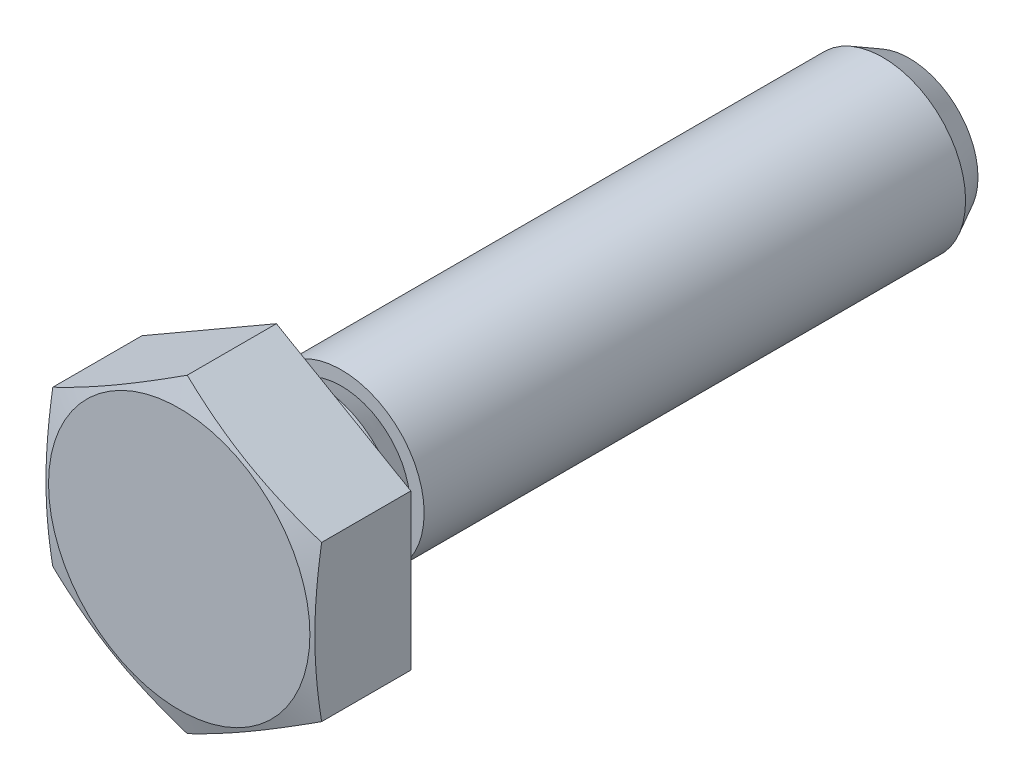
ISO-10303-21;
HEADER;
FILE_DESCRIPTION(('STEP AP214'),'2;1');
FILE_NAME('part.step','',(''),(''),'','','');
FILE_SCHEMA(('AUTOMOTIVE_DESIGN { 1 0 10303 214 1 1 1 1 }'));
ENDSEC;
DATA;
#1=APPLICATION_CONTEXT('core data for automotive mechanical design processes');
#2=APPLICATION_PROTOCOL_DEFINITION('international standard','automotive_design',2000,#1);
#3=PRODUCT_CONTEXT('',#1,'mechanical');
#4=PRODUCT('Part','Part','',(#3));
#5=PRODUCT_RELATED_PRODUCT_CATEGORY('part','',(#4));
#6=PRODUCT_DEFINITION_FORMATION('','',#4);
#7=PRODUCT_DEFINITION_CONTEXT('part definition',#1,'design');
#8=PRODUCT_DEFINITION('design','',#6,#7);
#9=PRODUCT_DEFINITION_SHAPE('','',#8);
#10=(LENGTH_UNIT() NAMED_UNIT(*) SI_UNIT(.MILLI.,.METRE.));
#11=(NAMED_UNIT(*) PLANE_ANGLE_UNIT() SI_UNIT($,.RADIAN.));
#12=(NAMED_UNIT(*) SI_UNIT($,.STERADIAN.) SOLID_ANGLE_UNIT());
#13=UNCERTAINTY_MEASURE_WITH_UNIT(LENGTH_MEASURE(1.E-05),#10,'distance_accuracy_value','');
#14=(GEOMETRIC_REPRESENTATION_CONTEXT(3) GLOBAL_UNCERTAINTY_ASSIGNED_CONTEXT((#13)) GLOBAL_UNIT_ASSIGNED_CONTEXT((#10,
#11,#12)) REPRESENTATION_CONTEXT('',''));
#15=CARTESIAN_POINT('',(0.,0.,0.));
#16=DIRECTION('',(0.,0.,1.));
#17=DIRECTION('',(1.,0.,0.));
#18=AXIS2_PLACEMENT_3D('',#15,#16,#17);
#19=CARTESIAN_POINT('',(0.,0.,0.6));
#20=DIRECTION('',(0.,0.,1.));
#21=DIRECTION('',(1.,0.,0.));
#22=AXIS2_PLACEMENT_3D('',#19,#20,#21);
#23=TOROIDAL_SURFACE('',#22,5.1,0.6);
#24=CARTESIAN_POINT('',(0.,0.,0.6));
#25=DIRECTION('',(0.,0.,1.));
#26=DIRECTION('',(1.,0.,0.));
#27=AXIS2_PLACEMENT_3D('',#24,#25,#26);
#28=CIRCLE('',#27,5.7);
#29=CARTESIAN_POINT('',(5.7,0.,0.6));
#30=VERTEX_POINT('',#29);
#31=EDGE_CURVE('E11',#30,#30,#28,.T.);
#32=ORIENTED_EDGE('',*,*,#31,.F.);
#33=EDGE_LOOP('',(#32));
#34=FACE_BOUND('',#33,.T.);
#35=CARTESIAN_POINT('',(0.,0.,0.));
#36=DIRECTION('',(0.,0.,1.));
#37=DIRECTION('',(1.,0.,0.));
#38=AXIS2_PLACEMENT_3D('',#35,#36,#37);
#39=CIRCLE('',#38,5.1);
#40=CARTESIAN_POINT('',(5.1,0.,0.));
#41=VERTEX_POINT('',#40);
#42=EDGE_CURVE('E24',#41,#41,#39,.T.);
#43=ORIENTED_EDGE('',*,*,#42,.T.);
#44=EDGE_LOOP('',(#43));
#45=FACE_BOUND('',#44,.T.);
#46=ADVANCED_FACE('F17',(#34,#45),#23,.T.);
#47=CARTESIAN_POINT('',(0.,5.1,0.));
#48=DIRECTION('',(0.,0.,-1.));
#49=DIRECTION('',(-1.,0.,0.));
#50=AXIS2_PLACEMENT_3D('',#47,#48,#49);
#51=PLANE('',#50);
#52=CARTESIAN_POINT('',(0.,0.,0.));
#53=DIRECTION('',(0.,0.,1.));
#54=DIRECTION('',(1.,0.,0.));
#55=AXIS2_PLACEMENT_3D('',#52,#53,#54);
#56=CIRCLE('',#55,4.4);
#57=CARTESIAN_POINT('',(4.4,0.,0.));
#58=VERTEX_POINT('',#57);
#59=EDGE_CURVE('E118',#58,#58,#56,.T.);
#60=ORIENTED_EDGE('',*,*,#59,.T.);
#61=EDGE_LOOP('',(#60));
#62=FACE_BOUND('',#61,.T.);
#63=ORIENTED_EDGE('',*,*,#42,.F.);
#64=EDGE_LOOP('',(#63));
#65=FACE_BOUND('',#64,.T.);
#66=ADVANCED_FACE('F124',(#62,#65),#51,.T.);
#67=CARTESIAN_POINT('',(0.,0.,-0.4));
#68=DIRECTION('',(0.,0.,1.));
#69=DIRECTION('',(1.,0.,0.));
#70=AXIS2_PLACEMENT_3D('',#67,#68,#69);
#71=TOROIDAL_SURFACE('',#70,4.4,0.4);
#72=CARTESIAN_POINT('',(0.,0.,-0.4));
#73=DIRECTION('',(0.,0.,1.));
#74=DIRECTION('',(1.,0.,0.));
#75=AXIS2_PLACEMENT_3D('',#72,#73,#74);
#76=CIRCLE('',#75,4.);
#77=CARTESIAN_POINT('',(4.,0.,-0.4));
#78=VERTEX_POINT('',#77);
#79=EDGE_CURVE('E115',#78,#78,#76,.T.);
#80=ORIENTED_EDGE('',*,*,#79,.T.);
#81=EDGE_LOOP('',(#80));
#82=FACE_BOUND('',#81,.T.);
#83=ORIENTED_EDGE('',*,*,#59,.F.);
#84=EDGE_LOOP('',(#83));
#85=FACE_BOUND('',#84,.T.);
#86=ADVANCED_FACE('F126',(#82,#85),#71,.F.);
#87=CARTESIAN_POINT('',(0.,0.,0.6));
#88=DIRECTION('',(0.,0.,1.));
#89=DIRECTION('',(1.,0.,0.));
#90=AXIS2_PLACEMENT_3D('',#87,#88,#89);
#91=CYLINDRICAL_SURFACE('',#90,4.);
#92=CARTESIAN_POINT('',(0.,0.,-1.37215937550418));
#93=DIRECTION('',(0.,0.,1.));
#94=DIRECTION('',(1.,0.,0.));
#95=AXIS2_PLACEMENT_3D('',#92,#93,#94);
#96=CIRCLE('',#95,4.);
#97=CARTESIAN_POINT('',(4.,0.,-1.37215937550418));
#98=VERTEX_POINT('',#97);
#99=EDGE_CURVE('E112',#98,#98,#96,.T.);
#100=ORIENTED_EDGE('',*,*,#99,.T.);
#101=EDGE_LOOP('',(#100));
#102=FACE_BOUND('',#101,.T.);
#103=ORIENTED_EDGE('',*,*,#79,.F.);
#104=EDGE_LOOP('',(#103));
#105=FACE_BOUND('',#104,.T.);
#106=ADVANCED_FACE('F133',(#102,#105),#91,.T.);
#107=CARTESIAN_POINT('',(0.,0.,-1.37215937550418));
#108=DIRECTION('',(0.,0.,1.));
#109=DIRECTION('',(1.,0.,0.));
#110=AXIS2_PLACEMENT_3D('',#107,#108,#109);
#111=CONICAL_SURFACE('',#110,4.,0.523598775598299);
#112=CARTESIAN_POINT('',(0.,0.,-2.544));
#113=DIRECTION('',(0.,0.,1.));
#114=DIRECTION('',(1.,0.,0.));
#115=AXIS2_PLACEMENT_3D('',#112,#113,#114);
#116=CIRCLE('',#115,3.3234375);
#117=CARTESIAN_POINT('',(3.3234375,0.,-2.544));
#118=VERTEX_POINT('',#117);
#119=EDGE_CURVE('E109',#118,#118,#116,.T.);
#120=ORIENTED_EDGE('',*,*,#119,.T.);
#121=EDGE_LOOP('',(#120));
#122=FACE_BOUND('',#121,.T.);
#123=ORIENTED_EDGE('',*,*,#99,.F.);
#124=EDGE_LOOP('',(#123));
#125=FACE_BOUND('',#124,.T.);
#126=ADVANCED_FACE('F140',(#122,#125),#111,.T.);
#127=CARTESIAN_POINT('',(0.,3.3234375,-2.544));
#128=DIRECTION('',(0.,0.,1.));
#129=DIRECTION('',(1.,0.,0.));
#130=AXIS2_PLACEMENT_3D('',#127,#128,#129);
#131=PLANE('',#130);
#132=CARTESIAN_POINT('',(0.,0.,-2.544));
#133=DIRECTION('',(0.,0.,1.));
#134=DIRECTION('',(1.,0.,0.));
#135=AXIS2_PLACEMENT_3D('',#132,#133,#134);
#136=CIRCLE('',#135,4.);
#137=CARTESIAN_POINT('',(4.,0.,-2.544));
#138=VERTEX_POINT('',#137);
#139=EDGE_CURVE('E106',#138,#138,#136,.T.);
#140=ORIENTED_EDGE('',*,*,#139,.T.);
#141=EDGE_LOOP('',(#140));
#142=FACE_BOUND('',#141,.T.);
#143=ORIENTED_EDGE('',*,*,#119,.F.);
#144=EDGE_LOOP('',(#143));
#145=FACE_BOUND('',#144,.T.);
#146=ADVANCED_FACE('F144',(#142,#145),#131,.T.);
#147=CARTESIAN_POINT('',(0.,0.,0.6));
#148=DIRECTION('',(0.,0.,1.));
#149=DIRECTION('',(1.,0.,0.));
#150=AXIS2_PLACEMENT_3D('',#147,#148,#149);
#151=CYLINDRICAL_SURFACE('',#150,4.);
#152=CARTESIAN_POINT('',(0.,0.,-28.7234375));
#153=DIRECTION('',(0.,0.,1.));
#154=DIRECTION('',(1.,0.,0.));
#155=AXIS2_PLACEMENT_3D('',#152,#153,#154);
#156=CIRCLE('',#155,4.);
#157=CARTESIAN_POINT('',(4.,0.,-28.7234375));
#158=VERTEX_POINT('',#157);
#159=EDGE_CURVE('E103',#158,#158,#156,.T.);
#160=ORIENTED_EDGE('',*,*,#159,.T.);
#161=EDGE_LOOP('',(#160));
#162=FACE_BOUND('',#161,.T.);
#163=ORIENTED_EDGE('',*,*,#139,.F.);
#164=EDGE_LOOP('',(#163));
#165=FACE_BOUND('',#164,.T.);
#166=ADVANCED_FACE('F148',(#162,#165),#151,.T.);
#167=CARTESIAN_POINT('',(0.,0.,-28.7234375));
#168=DIRECTION('',(0.,0.,1.));
#169=DIRECTION('',(1.,0.,0.));
#170=AXIS2_PLACEMENT_3D('',#167,#168,#169);
#171=CONICAL_SURFACE('',#170,4.,0.487349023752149);
#172=CARTESIAN_POINT('',(0.,0.,-30.));
#173=DIRECTION('',(0.,0.,1.));
#174=DIRECTION('',(1.,0.,0.));
#175=AXIS2_PLACEMENT_3D('',#172,#173,#174);
#176=CIRCLE('',#175,3.3234375);
#177=CARTESIAN_POINT('',(3.3234375,0.,-30.));
#178=VERTEX_POINT('',#177);
#179=EDGE_CURVE('E100',#178,#178,#176,.T.);
#180=ORIENTED_EDGE('',*,*,#179,.T.);
#181=EDGE_LOOP('',(#180));
#182=FACE_BOUND('',#181,.T.);
#183=ORIENTED_EDGE('',*,*,#159,.F.);
#184=EDGE_LOOP('',(#183));
#185=FACE_BOUND('',#184,.T.);
#186=ADVANCED_FACE('F152',(#182,#185),#171,.T.);
#187=CARTESIAN_POINT('',(0.,3.3234375,-30.));
#188=DIRECTION('',(0.,0.,-1.));
#189=DIRECTION('',(-1.,0.,0.));
#190=AXIS2_PLACEMENT_3D('',#187,#188,#189);
#191=PLANE('',#190);
#192=ORIENTED_EDGE('',*,*,#179,.F.);
#193=EDGE_LOOP('',(#192));
#194=FACE_BOUND('',#193,.T.);
#195=ADVANCED_FACE('F156',(#194),#191,.T.);
#196=CARTESIAN_POINT('',(-6.5,-3.752775,0.6));
#197=DIRECTION('',(0.,0.,-1.));
#198=DIRECTION('',(-1.,0.,0.));
#199=AXIS2_PLACEMENT_3D('',#196,#197,#198);
#200=PLANE('',#199);
#201=DIRECTION('',(0.,-1.,0.));
#202=VECTOR('',#201,1.);
#203=CARTESIAN_POINT('',(-6.5,3.752775,0.6));
#204=LINE('',#203,#202);
#205=CARTESIAN_POINT('',(-6.5,3.752775,0.6));
#206=VERTEX_POINT('',#205);
#207=CARTESIAN_POINT('',(-6.5,-3.752775,0.6));
#208=VERTEX_POINT('',#207);
#209=EDGE_CURVE('E83',#206,#208,#204,.T.);
#210=ORIENTED_EDGE('',*,*,#209,.F.);
#211=DIRECTION('',(0.866025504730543,0.499999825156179,0.));
#212=VECTOR('',#211,1.);
#213=CARTESIAN_POINT('',(-6.5,3.752775,0.6));
#214=LINE('',#213,#212);
#215=CARTESIAN_POINT('',(0.,7.50555,0.6));
#216=VERTEX_POINT('',#215);
#217=EDGE_CURVE('E88',#206,#216,#214,.T.);
#218=ORIENTED_EDGE('',*,*,#217,.T.);
#219=DIRECTION('',(0.866025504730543,-0.499999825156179,0.));
#220=VECTOR('',#219,1.);
#221=CARTESIAN_POINT('',(0.,7.50555,0.6));
#222=LINE('',#221,#220);
#223=CARTESIAN_POINT('',(6.5,3.752775,0.6));
#224=VERTEX_POINT('',#223);
#225=EDGE_CURVE('E94',#216,#224,#222,.T.);
#226=ORIENTED_EDGE('',*,*,#225,.T.);
#227=DIRECTION('',(0.,-1.,0.));
#228=VECTOR('',#227,1.);
#229=CARTESIAN_POINT('',(6.5,3.752775,0.6));
#230=LINE('',#229,#228);
#231=CARTESIAN_POINT('',(6.5,-3.752775,0.6));
#232=VERTEX_POINT('',#231);
#233=EDGE_CURVE('E246',#224,#232,#230,.T.);
#234=ORIENTED_EDGE('',*,*,#233,.T.);
#235=DIRECTION('',(-0.866025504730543,-0.499999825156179,0.));
#236=VECTOR('',#235,1.);
#237=CARTESIAN_POINT('',(6.5,-3.752775,0.6));
#238=LINE('',#237,#236);
#239=CARTESIAN_POINT('',(0.,-7.50555,0.6));
#240=VERTEX_POINT('',#239);
#241=EDGE_CURVE('E232',#232,#240,#238,.T.);
#242=ORIENTED_EDGE('',*,*,#241,.T.);
#243=DIRECTION('',(-0.866025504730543,0.499999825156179,0.));
#244=VECTOR('',#243,1.);
#245=CARTESIAN_POINT('',(0.,-7.50555,0.6));
#246=LINE('',#245,#244);
#247=EDGE_CURVE('E230',#240,#208,#246,.T.);
#248=ORIENTED_EDGE('',*,*,#247,.T.);
#249=EDGE_LOOP('',(#210,#218,#226,#234,#242,#248));
#250=FACE_BOUND('',#249,.T.);
#251=ORIENTED_EDGE('',*,*,#31,.T.);
#252=EDGE_LOOP('',(#251));
#253=FACE_BOUND('',#252,.T.);
#254=ADVANCED_FACE('F160',(#250,#253),#200,.T.);
#255=CARTESIAN_POINT('',(-6.5,3.752775,0.6));
#256=DIRECTION('',(-1.,0.,0.));
#257=DIRECTION('',(0.,0.,1.));
#258=AXIS2_PLACEMENT_3D('',#255,#256,#257);
#259=PLANE('',#258);
#260=CARTESIAN_POINT('',(-6.5,4.3898181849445,4.80301736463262));
#261=CARTESIAN_POINT('',(-6.5,4.09098114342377,4.85753275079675));
#262=CARTESIAN_POINT('',(-6.5,3.79142042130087,4.90839258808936));
#263=CARTESIAN_POINT('',(-6.5,3.19074376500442,5.00106933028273));
#264=CARTESIAN_POINT('',(-6.5,2.88962706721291,5.04288125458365));
#265=CARTESIAN_POINT('',(-6.5,2.28634005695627,5.11563270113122));
#266=CARTESIAN_POINT('',(-6.5,1.98417098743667,5.14658231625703));
#267=CARTESIAN_POINT('',(-6.5,1.37885610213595,5.19600650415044));
#268=CARTESIAN_POINT('',(-6.5,1.0757104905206,5.21448353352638));
#269=CARTESIAN_POINT('',(-6.5,0.473199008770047,5.23765885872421));
#270=CARTESIAN_POINT('',(-6.5,0.173840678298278,5.24254932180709));
#271=CARTESIAN_POINT('',(-6.5,-0.424803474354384,5.23878261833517));
#272=CARTESIAN_POINT('',(-6.5,-0.724089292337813,5.23012479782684));
#273=CARTESIAN_POINT('',(-6.5,-1.32190400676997,5.19982341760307));
#274=CARTESIAN_POINT('',(-6.5,-1.62043309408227,5.1781835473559));
#275=CARTESIAN_POINT('',(-6.5,-2.21639634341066,5.12318405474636));
#276=CARTESIAN_POINT('',(-6.5,-2.51383048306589,5.08982419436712));
#277=CARTESIAN_POINT('',(-6.5,-3.10949215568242,5.01274668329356));
#278=CARTESIAN_POINT('',(-6.5,-3.4077102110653,4.96895683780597));
#279=CARTESIAN_POINT('',(-6.5,-4.00275973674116,4.87287774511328));
#280=CARTESIAN_POINT('',(-6.5,-4.29959119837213,4.82058844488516));
#281=CARTESIAN_POINT('',(-6.5,-4.89215745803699,4.70904950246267));
#282=CARTESIAN_POINT('',(-6.5,-5.18789129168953,4.6497947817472));
#283=CARTESIAN_POINT('',(-6.5,-5.77818646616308,4.52569811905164));
#284=CARTESIAN_POINT('',(-6.5,-6.0727477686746,4.46085599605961));
#285=CARTESIAN_POINT('',(-6.5,-6.66575277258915,4.32556160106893));
#286=CARTESIAN_POINT('',(-6.5,-6.96417913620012,4.25503370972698));
#287=CARTESIAN_POINT('',(-6.5,-7.56012687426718,4.11024969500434));
#288=CARTESIAN_POINT('',(-6.5,-7.85764823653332,4.03599352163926));
#289=CARTESIAN_POINT('',(-6.5,-8.45129351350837,3.88463909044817));
#290=CARTESIAN_POINT('',(-6.5,-8.7474190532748,3.80754718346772));
#291=CARTESIAN_POINT('',(-6.5,-9.33900160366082,3.65091210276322));
#292=CARTESIAN_POINT('',(-6.5,-9.63445865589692,3.57136908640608));
#293=CARTESIAN_POINT('',(-6.5,-9.9296486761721,3.49086478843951));
#294=B_SPLINE_CURVE_WITH_KNOTS('',3,(#260,#261,#262,#263,#264,#265,#266,#267,#268,#269,#270,
#271,#272,#273,#274,#275,#276,#277,#278,#279,#280,#281,#282,#283,#284,#285,#286,#287,#288,#289,
#290,#291,#292,#293),.UNSPECIFIED.,.F.,.F.,(4,2,2,2,2,2,2,2,2,2,2,2,2,2,2,2,4),(0.,
0.911367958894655,1.82323632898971,2.73425516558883,3.64509451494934,4.54298379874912,
5.44091642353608,6.33859397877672,7.23628976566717,8.14038972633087,9.04449532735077,
9.94926425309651,10.8540625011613,11.7739744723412,12.6938987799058,13.6118752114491,
14.5297928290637),.UNSPECIFIED.);
#295=CARTESIAN_POINT('',(-6.5,3.752775,4.91320410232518));
#296=VERTEX_POINT('',#295);
#297=CARTESIAN_POINT('',(-6.5,-3.752775,4.91320410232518));
#298=VERTEX_POINT('',#297);
#299=EDGE_CURVE('E72',#296,#298,#294,.T.);
#300=ORIENTED_EDGE('',*,*,#299,.F.);
#301=DIRECTION('',(0.,0.,1.));
#302=VECTOR('',#301,1.);
#303=CARTESIAN_POINT('',(-6.5,3.752775,0.6));
#304=LINE('',#303,#302);
#305=EDGE_CURVE('E81',#206,#296,#304,.T.);
#306=ORIENTED_EDGE('',*,*,#305,.F.);
#307=ORIENTED_EDGE('',*,*,#209,.T.);
#308=DIRECTION('',(0.,0.,1.));
#309=VECTOR('',#308,1.);
#310=CARTESIAN_POINT('',(-6.5,-3.752775,0.6));
#311=LINE('',#310,#309);
#312=EDGE_CURVE('E39',#208,#298,#311,.T.);
#313=ORIENTED_EDGE('',*,*,#312,.T.);
#314=EDGE_LOOP('',(#300,#306,#307,#313));
#315=FACE_BOUND('',#314,.T.);
#316=ADVANCED_FACE('F79',(#315),#259,.T.);
#317=CARTESIAN_POINT('',(0.,-7.50555,0.6));
#318=DIRECTION('',(0.499999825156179,0.866025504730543,0.));
#319=DIRECTION('',(0.866025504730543,-0.499999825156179,0.));
#320=AXIS2_PLACEMENT_3D('',#317,#318,#319);
#321=PLANE('',#320);
#322=DIRECTION('',(0.,0.,1.));
#323=VECTOR('',#322,1.);
#324=CARTESIAN_POINT('',(0.,-7.50555,0.6));
#325=LINE('',#324,#323);
#326=CARTESIAN_POINT('',(0.,-7.50555,4.91320495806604));
#327=VERTEX_POINT('',#326);
#328=EDGE_CURVE('E237',#240,#327,#325,.T.);
#329=ORIENTED_EDGE('',*,*,#328,.T.);
#330=CARTESIAN_POINT('',(2.00000000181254E-07,-7.50555011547,4.91320492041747));
#331=CARTESIAN_POINT('',(-0.269500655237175,-7.34995379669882,4.96395435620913));
#332=CARTESIAN_POINT('',(-0.539719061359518,-7.19394319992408,5.01007955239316));
#333=CARTESIAN_POINT('',(-1.08156698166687,-6.88110730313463,5.09118099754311));
#334=CARTESIAN_POINT('',(-1.35319726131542,-6.72428156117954,5.12615037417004));
#335=CARTESIAN_POINT('',(-1.89544179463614,-6.41121667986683,5.1827563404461));
#336=CARTESIAN_POINT('',(-2.16604804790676,-6.25498215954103,5.2044923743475));
#337=CARTESIAN_POINT('',(-2.70776966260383,-5.94221918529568,5.23364290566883));
#338=CARTESIAN_POINT('',(-2.97888485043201,-5.78569083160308,5.24106162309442));
#339=CARTESIAN_POINT('',(-3.52111522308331,-5.47263412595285,5.24106153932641));
#340=CARTESIAN_POINT('',(-3.79223040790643,-5.31610577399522,5.23364273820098));
#341=CARTESIAN_POINT('',(-4.33395201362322,-5.00334280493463,5.20449204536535));
#342=CARTESIAN_POINT('',(-4.60455826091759,-4.84710828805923,5.1827559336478));
#343=CARTESIAN_POINT('',(-5.14680278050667,-4.53404341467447,5.12614982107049));
#344=CARTESIAN_POINT('',(-5.41843305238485,-4.37721767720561,5.0911803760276));
#345=CARTESIAN_POINT('',(-5.96028095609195,-4.06438179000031,5.01007880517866));
#346=CARTESIAN_POINT('',(-6.23049935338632,-3.90837119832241,4.96395355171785));
#347=CARTESIAN_POINT('',(-6.5000002,-3.75277488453,4.91320406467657));
#348=B_SPLINE_CURVE_WITH_KNOTS('',3,(#330,#331,#332,#333,#334,#335,#336,#337,#338,#339,#340,
#341,#342,#343,#344,#345,#346,#347),.UNSPECIFIED.,.F.,.F.,(4,2,2,2,2,2,2,2,4),(0.,
0.945987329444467,1.89255629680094,2.83192136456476,3.77100951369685,4.71009765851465,
5.64946272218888,6.59603168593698,7.54201901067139),.UNSPECIFIED.);
#349=EDGE_CURVE('E84',#327,#298,#348,.T.);
#350=ORIENTED_EDGE('',*,*,#349,.T.);
#351=ORIENTED_EDGE('',*,*,#312,.F.);
#352=ORIENTED_EDGE('',*,*,#247,.F.);
#353=EDGE_LOOP('',(#329,#350,#351,#352));
#354=FACE_BOUND('',#353,.T.);
#355=ADVANCED_FACE('F165',(#354),#321,.F.);
#356=CARTESIAN_POINT('',(6.5,-3.752775,0.6));
#357=DIRECTION('',(-0.499999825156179,0.866025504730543,0.));
#358=DIRECTION('',(0.866025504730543,0.499999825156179,0.));
#359=AXIS2_PLACEMENT_3D('',#356,#357,#358);
#360=PLANE('',#359);
#361=DIRECTION('',(0.,0.,1.));
#362=VECTOR('',#361,1.);
#363=CARTESIAN_POINT('',(6.5,-3.752775,0.6));
#364=LINE('',#363,#362);
#365=CARTESIAN_POINT('',(6.5,-3.752775,4.91320410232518));
#366=VERTEX_POINT('',#365);
#367=EDGE_CURVE('E240',#232,#366,#364,.T.);
#368=ORIENTED_EDGE('',*,*,#367,.T.);
#369=CARTESIAN_POINT('',(6.5000002,-3.75277488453,4.91320406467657));
#370=CARTESIAN_POINT('',(6.23049935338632,-3.9083711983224,4.96395355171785));
#371=CARTESIAN_POINT('',(5.96028095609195,-4.06438179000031,5.01007880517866));
#372=CARTESIAN_POINT('',(5.41843305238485,-4.3772176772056,5.0911803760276));
#373=CARTESIAN_POINT('',(5.14680278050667,-4.53404341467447,5.12614982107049));
#374=CARTESIAN_POINT('',(4.60455826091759,-4.84710828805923,5.1827559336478));
#375=CARTESIAN_POINT('',(4.33395201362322,-5.00334280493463,5.20449204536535));
#376=CARTESIAN_POINT('',(3.79223040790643,-5.31610577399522,5.23364273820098));
#377=CARTESIAN_POINT('',(3.52111522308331,-5.47263412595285,5.24106153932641));
#378=CARTESIAN_POINT('',(2.97888485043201,-5.78569083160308,5.24106162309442));
#379=CARTESIAN_POINT('',(2.70776966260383,-5.94221918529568,5.23364290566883));
#380=CARTESIAN_POINT('',(2.16604804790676,-6.25498215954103,5.2044923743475));
#381=CARTESIAN_POINT('',(1.89544179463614,-6.41121667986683,5.1827563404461));
#382=CARTESIAN_POINT('',(1.35319726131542,-6.72428156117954,5.12615037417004));
#383=CARTESIAN_POINT('',(1.08156698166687,-6.88110730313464,5.09118099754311));
#384=CARTESIAN_POINT('',(0.539719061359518,-7.19394319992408,5.01007955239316));
#385=CARTESIAN_POINT('',(0.269500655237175,-7.34995379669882,4.96395435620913));
#386=CARTESIAN_POINT('',(-1.99999999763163E-07,-7.50555011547,4.91320492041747));
#387=B_SPLINE_CURVE_WITH_KNOTS('',3,(#369,#370,#371,#372,#373,#374,#375,#376,#377,#378,#379,
#380,#381,#382,#383,#384,#385,#386),.UNSPECIFIED.,.F.,.F.,(4,2,2,2,2,2,2,2,4),(0.,
0.945987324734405,1.89255628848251,2.83192135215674,3.77100949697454,4.71009764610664,
5.64946271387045,6.59603168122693,7.54201901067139),.UNSPECIFIED.);
#388=EDGE_CURVE('E203',#366,#327,#387,.T.);
#389=ORIENTED_EDGE('',*,*,#388,.T.);
#390=ORIENTED_EDGE('',*,*,#328,.F.);
#391=ORIENTED_EDGE('',*,*,#241,.F.);
#392=EDGE_LOOP('',(#368,#389,#390,#391));
#393=FACE_BOUND('',#392,.T.);
#394=ADVANCED_FACE('F208',(#393),#360,.F.);
#395=CARTESIAN_POINT('',(6.5,3.752775,0.6));
#396=DIRECTION('',(-1.,0.,0.));
#397=DIRECTION('',(0.,0.,1.));
#398=AXIS2_PLACEMENT_3D('',#395,#396,#397);
#399=PLANE('',#398);
#400=DIRECTION('',(0.,0.,1.));
#401=VECTOR('',#400,1.);
#402=CARTESIAN_POINT('',(6.5,3.752775,0.6));
#403=LINE('',#402,#401);
#404=CARTESIAN_POINT('',(6.5,3.752775,4.91320410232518));
#405=VERTEX_POINT('',#404);
#406=EDGE_CURVE('E92',#224,#405,#403,.T.);
#407=ORIENTED_EDGE('',*,*,#406,.T.);
#408=CARTESIAN_POINT('',(6.5,4.3898181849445,4.80301736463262));
#409=CARTESIAN_POINT('',(6.5,4.09098114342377,4.85753275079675));
#410=CARTESIAN_POINT('',(6.5,3.79142042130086,4.90839258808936));
#411=CARTESIAN_POINT('',(6.5,3.19074376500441,5.00106933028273));
#412=CARTESIAN_POINT('',(6.5,2.88962706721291,5.04288125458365));
#413=CARTESIAN_POINT('',(6.5,2.28634005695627,5.11563270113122));
#414=CARTESIAN_POINT('',(6.5,1.98417098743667,5.14658231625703));
#415=CARTESIAN_POINT('',(6.5,1.37885610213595,5.19600650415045));
#416=CARTESIAN_POINT('',(6.5,1.0757104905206,5.21448353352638));
#417=CARTESIAN_POINT('',(6.5,0.473199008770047,5.23765885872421));
#418=CARTESIAN_POINT('',(6.5,0.173840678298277,5.24254932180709));
#419=CARTESIAN_POINT('',(6.5,-0.424803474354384,5.23878261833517));
#420=CARTESIAN_POINT('',(6.5,-0.724089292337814,5.23012479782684));
#421=CARTESIAN_POINT('',(6.5,-1.32190400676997,5.19982341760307));
#422=CARTESIAN_POINT('',(6.5,-1.62043309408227,5.1781835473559));
#423=CARTESIAN_POINT('',(6.5,-2.21639634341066,5.12318405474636));
#424=CARTESIAN_POINT('',(6.5,-2.51383048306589,5.08982419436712));
#425=CARTESIAN_POINT('',(6.5,-3.10949215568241,5.01274668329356));
#426=CARTESIAN_POINT('',(6.5,-3.4077102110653,4.96895683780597));
#427=CARTESIAN_POINT('',(6.5,-4.00275973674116,4.87287774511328));
#428=CARTESIAN_POINT('',(6.5,-4.29959119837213,4.82058844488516));
#429=CARTESIAN_POINT('',(6.5,-4.89215745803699,4.70904950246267));
#430=CARTESIAN_POINT('',(6.5,-5.18789129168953,4.6497947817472));
#431=CARTESIAN_POINT('',(6.5,-5.77818646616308,4.52569811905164));
#432=CARTESIAN_POINT('',(6.5,-6.0727477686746,4.46085599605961));
#433=CARTESIAN_POINT('',(6.5,-6.66575277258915,4.32556160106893));
#434=CARTESIAN_POINT('',(6.5,-6.96417913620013,4.25503370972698));
#435=CARTESIAN_POINT('',(6.5,-7.56012687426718,4.11024969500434));
#436=CARTESIAN_POINT('',(6.5,-7.85764823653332,4.03599352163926));
#437=CARTESIAN_POINT('',(6.5,-8.45129351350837,3.88463909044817));
#438=CARTESIAN_POINT('',(6.5,-8.7474190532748,3.80754718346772));
#439=CARTESIAN_POINT('',(6.5,-9.33900160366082,3.65091210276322));
#440=CARTESIAN_POINT('',(6.5,-9.63445865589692,3.57136908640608));
#441=CARTESIAN_POINT('',(6.5,-9.9296486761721,3.49086478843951));
#442=B_SPLINE_CURVE_WITH_KNOTS('',3,(#408,#409,#410,#411,#412,#413,#414,#415,#416,#417,#418,
#419,#420,#421,#422,#423,#424,#425,#426,#427,#428,#429,#430,#431,#432,#433,#434,#435,#436,#437,
#438,#439,#440,#441),.UNSPECIFIED.,.F.,.F.,(4,2,2,2,2,2,2,2,2,2,2,2,2,2,2,2,4),(0.,
0.911367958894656,1.82323632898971,2.73425516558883,3.64509451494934,4.54298379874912,
5.44091642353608,6.33859397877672,7.23628976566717,8.14038972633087,9.04449532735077,
9.94926425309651,10.8540625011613,11.7739744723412,12.6938987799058,13.6118752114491,
14.5297928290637),.UNSPECIFIED.);
#443=EDGE_CURVE('E198',#405,#366,#442,.T.);
#444=ORIENTED_EDGE('',*,*,#443,.T.);
#445=ORIENTED_EDGE('',*,*,#367,.F.);
#446=ORIENTED_EDGE('',*,*,#233,.F.);
#447=EDGE_LOOP('',(#407,#444,#445,#446));
#448=FACE_BOUND('',#447,.T.);
#449=ADVANCED_FACE('F211',(#448),#399,.F.);
#450=CARTESIAN_POINT('',(0.,7.50555,0.6));
#451=DIRECTION('',(-0.499999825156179,-0.866025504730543,0.));
#452=DIRECTION('',(-0.866025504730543,0.499999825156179,0.));
#453=AXIS2_PLACEMENT_3D('',#450,#451,#452);
#454=PLANE('',#453);
#455=DIRECTION('',(0.,0.,1.));
#456=VECTOR('',#455,1.);
#457=CARTESIAN_POINT('',(0.,7.50555,0.6));
#458=LINE('',#457,#456);
#459=CARTESIAN_POINT('',(0.,7.50555,4.91320495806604));
#460=VERTEX_POINT('',#459);
#461=EDGE_CURVE('E90',#216,#460,#458,.T.);
#462=ORIENTED_EDGE('',*,*,#461,.T.);
#463=CARTESIAN_POINT('',(-1.99999999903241E-07,7.50555011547,4.91320492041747));
#464=CARTESIAN_POINT('',(0.269500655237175,7.34995379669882,4.96395435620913));
#465=CARTESIAN_POINT('',(0.539719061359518,7.19394319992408,5.01007955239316));
#466=CARTESIAN_POINT('',(1.08156698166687,6.88110730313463,5.09118099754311));
#467=CARTESIAN_POINT('',(1.35319726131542,6.72428156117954,5.12615037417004));
#468=CARTESIAN_POINT('',(1.89544179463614,6.41121667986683,5.1827563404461));
#469=CARTESIAN_POINT('',(2.16604804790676,6.25498215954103,5.2044923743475));
#470=CARTESIAN_POINT('',(2.70776966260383,5.94221918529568,5.23364290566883));
#471=CARTESIAN_POINT('',(2.97888485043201,5.78569083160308,5.24106162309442));
#472=CARTESIAN_POINT('',(3.52111522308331,5.47263412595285,5.24106153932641));
#473=CARTESIAN_POINT('',(3.79223040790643,5.31610577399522,5.23364273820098));
#474=CARTESIAN_POINT('',(4.33395201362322,5.00334280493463,5.20449204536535));
#475=CARTESIAN_POINT('',(4.60455826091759,4.84710828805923,5.1827559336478));
#476=CARTESIAN_POINT('',(5.14680278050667,4.53404341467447,5.12614982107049));
#477=CARTESIAN_POINT('',(5.41843305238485,4.37721767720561,5.0911803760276));
#478=CARTESIAN_POINT('',(5.96028095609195,4.06438179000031,5.01007880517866));
#479=CARTESIAN_POINT('',(6.23049935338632,3.90837119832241,4.96395355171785));
#480=CARTESIAN_POINT('',(6.5000002,3.75277488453,4.91320406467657));
#481=B_SPLINE_CURVE_WITH_KNOTS('',3,(#463,#464,#465,#466,#467,#468,#469,#470,#471,#472,#473,
#474,#475,#476,#477,#478,#479,#480),.UNSPECIFIED.,.F.,.F.,(4,2,2,2,2,2,2,2,4),(0.,
0.945987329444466,1.89255629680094,2.83192136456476,3.77100951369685,4.71009765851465,
5.64946272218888,6.59603168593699,7.54201901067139),.UNSPECIFIED.);
#482=EDGE_CURVE('E31',#460,#405,#481,.T.);
#483=ORIENTED_EDGE('',*,*,#482,.T.);
#484=ORIENTED_EDGE('',*,*,#406,.F.);
#485=ORIENTED_EDGE('',*,*,#225,.F.);
#486=EDGE_LOOP('',(#462,#483,#484,#485));
#487=FACE_BOUND('',#486,.T.);
#488=ADVANCED_FACE('F215',(#487),#454,.F.);
#489=CARTESIAN_POINT('',(-6.5,3.752775,0.6));
#490=DIRECTION('',(0.499999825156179,-0.866025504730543,0.));
#491=DIRECTION('',(-0.866025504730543,-0.499999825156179,0.));
#492=AXIS2_PLACEMENT_3D('',#489,#490,#491);
#493=PLANE('',#492);
#494=ORIENTED_EDGE('',*,*,#305,.T.);
#495=CARTESIAN_POINT('',(-6.5000002,3.75277488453,4.91320406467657));
#496=CARTESIAN_POINT('',(-6.23049935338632,3.90837119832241,4.96395355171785));
#497=CARTESIAN_POINT('',(-5.96028095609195,4.06438179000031,5.01007880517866));
#498=CARTESIAN_POINT('',(-5.41843305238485,4.37721767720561,5.0911803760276));
#499=CARTESIAN_POINT('',(-5.14680278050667,4.53404341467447,5.12614982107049));
#500=CARTESIAN_POINT('',(-4.60455826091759,4.84710828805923,5.1827559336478));
#501=CARTESIAN_POINT('',(-4.33395201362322,5.00334280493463,5.20449204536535));
#502=CARTESIAN_POINT('',(-3.79223040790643,5.31610577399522,5.23364273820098));
#503=CARTESIAN_POINT('',(-3.52111522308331,5.47263412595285,5.24106153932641));
#504=CARTESIAN_POINT('',(-2.97888485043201,5.78569083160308,5.24106162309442));
#505=CARTESIAN_POINT('',(-2.70776966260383,5.94221918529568,5.23364290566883));
#506=CARTESIAN_POINT('',(-2.16604804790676,6.25498215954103,5.2044923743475));
#507=CARTESIAN_POINT('',(-1.89544179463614,6.41121667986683,5.1827563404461));
#508=CARTESIAN_POINT('',(-1.35319726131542,6.72428156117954,5.12615037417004));
#509=CARTESIAN_POINT('',(-1.08156698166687,6.88110730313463,5.09118099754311));
#510=CARTESIAN_POINT('',(-0.539719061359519,7.19394319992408,5.01007955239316));
#511=CARTESIAN_POINT('',(-0.269500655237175,7.34995379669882,4.96395435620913));
#512=CARTESIAN_POINT('',(1.999999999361E-07,7.50555011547,4.91320492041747));
#513=B_SPLINE_CURVE_WITH_KNOTS('',3,(#495,#496,#497,#498,#499,#500,#501,#502,#503,#504,#505,
#506,#507,#508,#509,#510,#511,#512),.UNSPECIFIED.,.F.,.F.,(4,2,2,2,2,2,2,2,4),(0.,
0.945987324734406,1.89255628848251,2.83192135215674,3.77100949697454,4.71009764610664,
5.64946271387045,6.59603168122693,7.54201901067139),.UNSPECIFIED.);
#514=EDGE_CURVE('E68',#296,#460,#513,.T.);
#515=ORIENTED_EDGE('',*,*,#514,.T.);
#516=ORIENTED_EDGE('',*,*,#461,.F.);
#517=ORIENTED_EDGE('',*,*,#217,.F.);
#518=EDGE_LOOP('',(#494,#515,#516,#517));
#519=FACE_BOUND('',#518,.T.);
#520=ADVANCED_FACE('F86',(#519),#493,.F.);
#521=CARTESIAN_POINT('',(0.,0.,4.86426181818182));
#522=DIRECTION('',(0.,0.,-1.));
#523=DIRECTION('',(-1.,0.,0.));
#524=AXIS2_PLACEMENT_3D('',#521,#522,#523);
#525=CONICAL_SURFACE('',#524,7.655661,1.25561835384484);
#526=ORIENTED_EDGE('',*,*,#299,.T.);
#527=ORIENTED_EDGE('',*,*,#349,.F.);
#528=ORIENTED_EDGE('',*,*,#388,.F.);
#529=ORIENTED_EDGE('',*,*,#443,.F.);
#530=ORIENTED_EDGE('',*,*,#482,.F.);
#531=ORIENTED_EDGE('',*,*,#514,.F.);
#532=EDGE_LOOP('',(#526,#527,#528,#529,#530,#531));
#533=FACE_BOUND('',#532,.T.);
#534=CARTESIAN_POINT('',(0.,0.,5.3));
#535=DIRECTION('',(0.,0.,-1.));
#536=DIRECTION('',(-1.,0.,0.));
#537=AXIS2_PLACEMENT_3D('',#534,#535,#536);
#538=CIRCLE('',#537,6.319230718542);
#539=CARTESIAN_POINT('',(-6.319230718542,0.,5.3));
#540=VERTEX_POINT('',#539);
#541=EDGE_CURVE('E76',#540,#540,#538,.F.);
#542=ORIENTED_EDGE('',*,*,#541,.F.);
#543=EDGE_LOOP('',(#542));
#544=FACE_BOUND('',#543,.T.);
#545=ADVANCED_FACE('F70',(#533,#544),#525,.T.);
#546=CARTESIAN_POINT('',(-6.5,-3.752775,5.3));
#547=DIRECTION('',(0.,0.,-1.));
#548=DIRECTION('',(-1.,0.,0.));
#549=AXIS2_PLACEMENT_3D('',#546,#547,#548);
#550=PLANE('',#549);
#551=ORIENTED_EDGE('',*,*,#541,.T.);
#552=EDGE_LOOP('',(#551));
#553=FACE_BOUND('',#552,.T.);
#554=ADVANCED_FACE('F181',(#553),#550,.F.);
#555=CLOSED_SHELL('',(#46,#66,#86,#106,#126,#146,#166,#186,#195,#254,#316,#355,#394,#449,#488,
#520,#545,#554));
#556=MANIFOLD_SOLID_BREP('B1',#555);
#557=ADVANCED_BREP_SHAPE_REPRESENTATION('',(#18,#556),#14);
#558=SHAPE_DEFINITION_REPRESENTATION(#9,#557);
ENDSEC;
END-ISO-10303-21;
